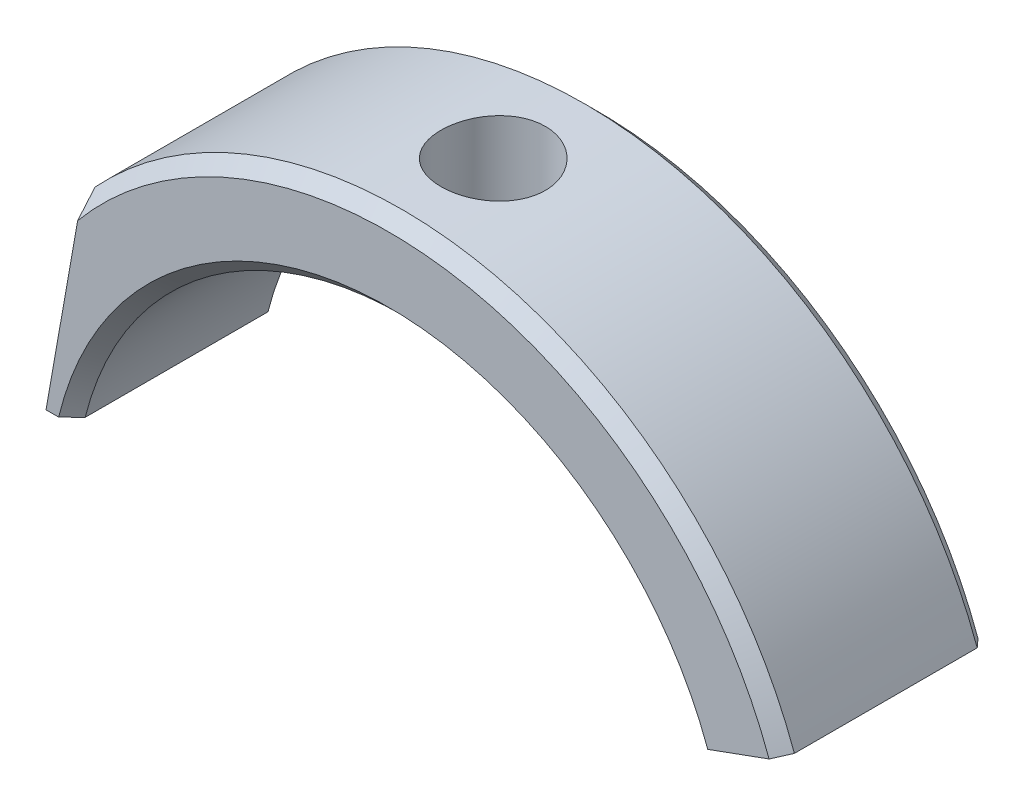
from build123d import *

# Parameters (mm, degrees)
BASE_EXTRUSION_DEPTH    = 4
ESQUISSE2_R             = 2
ENL_V_MAT_EXTRU_2_DEPTH = 23.317116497
CHANFREIN2_SIZE         = 0.5


with BuildPart() as part:
    # Esquisse1 → Base-Extrusion (new, symmetric)
    with BuildSketch(Plane.XY):
        with BuildLine():
            Line((-11.745213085, 10.865080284), (-13.125659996, 3.036176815))
            Line((-13.125659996, 3.036176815), (-12.125659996, 3.036176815))
            ThreePointArc((-12.125659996, 3.036176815), (-0.647944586, 12.483195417), (11.74615776, 4.275251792))
            Line((11.74615776, 4.275251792), (15.035081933, 5.472322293))
            ThreePointArc((15.035081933, 5.472322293), (3.158523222, 15.685143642), (-11.745213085, 10.865080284))
        make_face()
    extrude(amount=BASE_EXTRUSION_DEPTH, both=True)

    # Esquisse2 → Enl_v. mat.-Extru.2 (cut, through all)
    with BuildSketch(Plane(origin=(0, 0, 0), x_dir=(1, 0, 0), z_dir=(0, 1, 0))):
        with Locations(Location((0, 0, 0), (0, 0, 90))):
            Circle(ESQUISSE2_R)
    extrude(amount=ENL_V_MAT_EXTRU_2_DEPTH, mode=Mode.SUBTRACT)

    # Chanfrein2
    chanfrein2_edges = [part.edges().sort_by_distance(p)[0] for p in [
        (-0.647944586, 12.483195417, -4),
        (3.158523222, 15.685143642, -4),
        (-0.647944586, 12.483195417, 4),
        (3.158523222, 15.685143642, 4),
    ]]
    chamfer(chanfrein2_edges, length=CHANFREIN2_SIZE)


solid = part.part
